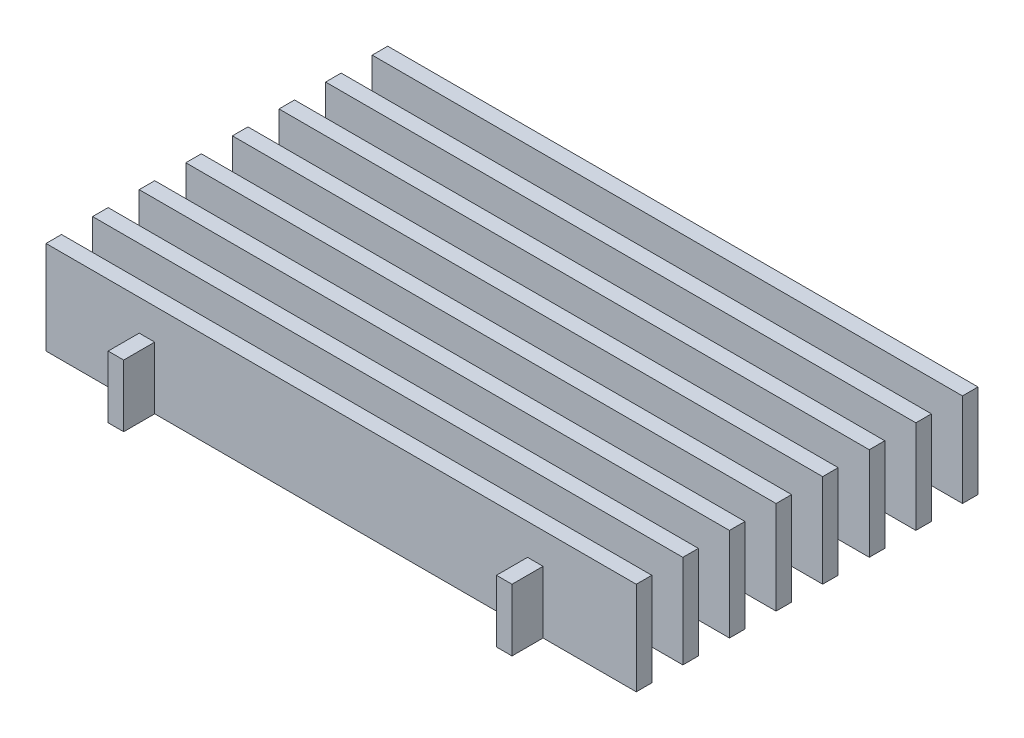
from build123d import *

# Parameters (mm, degrees)
SKETCH2_W             = 120.65
SKETCH2_H             = 3.175
BOSS_EXTRUDE1_DEPTH   = 9.525
BOSS_EXTRUDE1_2_DEPTH = 9.525
BOSS_EXTRUDE1_3_DEPTH = 9.525
BOSS_EXTRUDE1_4_DEPTH = 9.525
BOSS_EXTRUDE1_5_DEPTH = 9.525
BOSS_EXTRUDE1_6_DEPTH = 9.525
BOSS_EXTRUDE1_7_DEPTH = 9.525
BOSS_EXTRUDE1_8_DEPTH = 9.525
SKETCH3_W             = 3.175
SKETCH3_H             = 82.55
BOSS_EXTRUDE2_DEPTH   = 12.7


with BuildPart() as part:
    # Sketch2 → Boss-Extrude1 (new, symmetric)
    with BuildSketch(Plane(origin=(0, 0, 0), x_dir=(1, 0, 0), z_dir=(0, 1, 0))):
        with Locations((0, -33.3375)):
            Rectangle(SKETCH2_W, SKETCH2_H)
    extrude(amount=BOSS_EXTRUDE1_DEPTH, both=True)



with BuildPart() as body_2:
    # Sketch2 → Boss-Extrude1 2 (new, symmetric)
    with BuildSketch(Plane(origin=(0, 0, 0), x_dir=(1, 0, 0), z_dir=(0, 1, 0))):
        with Locations((0, -23.8125)):
            Rectangle(SKETCH2_W, SKETCH2_H)
    extrude(amount=BOSS_EXTRUDE1_2_DEPTH, both=True)


with BuildPart() as body_3:
    # Sketch2 → Boss-Extrude1 3 (new, symmetric)
    with BuildSketch(Plane(origin=(0, 0, 0), x_dir=(1, 0, 0), z_dir=(0, 1, 0))):
        with Locations((0, -14.2875)):
            Rectangle(SKETCH2_W, SKETCH2_H)
    extrude(amount=BOSS_EXTRUDE1_3_DEPTH, both=True)


with BuildPart() as body_4:
    # Sketch2 → Boss-Extrude1 4 (new, symmetric)
    with BuildSketch(Plane(origin=(0, 0, 0), x_dir=(1, 0, 0), z_dir=(0, 1, 0))):
        with Locations((0, -4.7625)):
            Rectangle(SKETCH2_W, SKETCH2_H)
    extrude(amount=BOSS_EXTRUDE1_4_DEPTH, both=True)


with BuildPart() as body_5:
    # Sketch2 → Boss-Extrude1 5 (new, symmetric)
    with BuildSketch(Plane(origin=(0, 0, 0), x_dir=(1, 0, 0), z_dir=(0, 1, 0))):
        with Locations((0, 4.7625)):
            Rectangle(SKETCH2_W, SKETCH2_H)
    extrude(amount=BOSS_EXTRUDE1_5_DEPTH, both=True)


with BuildPart() as body_6:
    # Sketch2 → Boss-Extrude1 6 (new, symmetric)
    with BuildSketch(Plane(origin=(0, 0, 0), x_dir=(1, 0, 0), z_dir=(0, 1, 0))):
        with Locations((0, 14.2875)):
            Rectangle(SKETCH2_W, SKETCH2_H)
    extrude(amount=BOSS_EXTRUDE1_6_DEPTH, both=True)


with BuildPart() as body_7:
    # Sketch2 → Boss-Extrude1 7 (new, symmetric)
    with BuildSketch(Plane(origin=(0, 0, 0), x_dir=(1, 0, 0), z_dir=(0, 1, 0))):
        with Locations((0, 23.8125)):
            Rectangle(SKETCH2_W, SKETCH2_H)
    extrude(amount=BOSS_EXTRUDE1_7_DEPTH, both=True)


with BuildPart() as body_8:
    # Sketch2 → Boss-Extrude1 8 (new, symmetric)
    with BuildSketch(Plane(origin=(0, 0, 0), x_dir=(1, 0, 0), z_dir=(0, 1, 0))):
        with Locations((0, 33.3375)):
            Rectangle(SKETCH2_W, SKETCH2_H)
    extrude(amount=BOSS_EXTRUDE1_8_DEPTH, both=True)


with BuildPart() as part_1:
    add(part.part)

    add(body_2.part)  # Boss-Extrude2 merges body 2

    add(body_3.part)  # Boss-Extrude2 merges body 3

    add(body_4.part)  # Boss-Extrude2 merges body 4

    add(body_5.part)  # Boss-Extrude2 merges body 5

    add(body_6.part)  # Boss-Extrude2 merges body 6

    add(body_7.part)  # Boss-Extrude2 merges body 7

    add(body_8.part)  # Boss-Extrude2 merges body 8
    # Sketch3 → Boss-Extrude2 (add)
    with BuildSketch(Plane.XZ.offset(9.525)):
        with Locations((-39.6875, 0)):
            Rectangle(SKETCH3_W, SKETCH3_H)
        with Locations((39.6875, 0)):
            Rectangle(SKETCH3_W, SKETCH3_H)
    extrude(amount=-BOSS_EXTRUDE2_DEPTH)


solid = part_1.part
